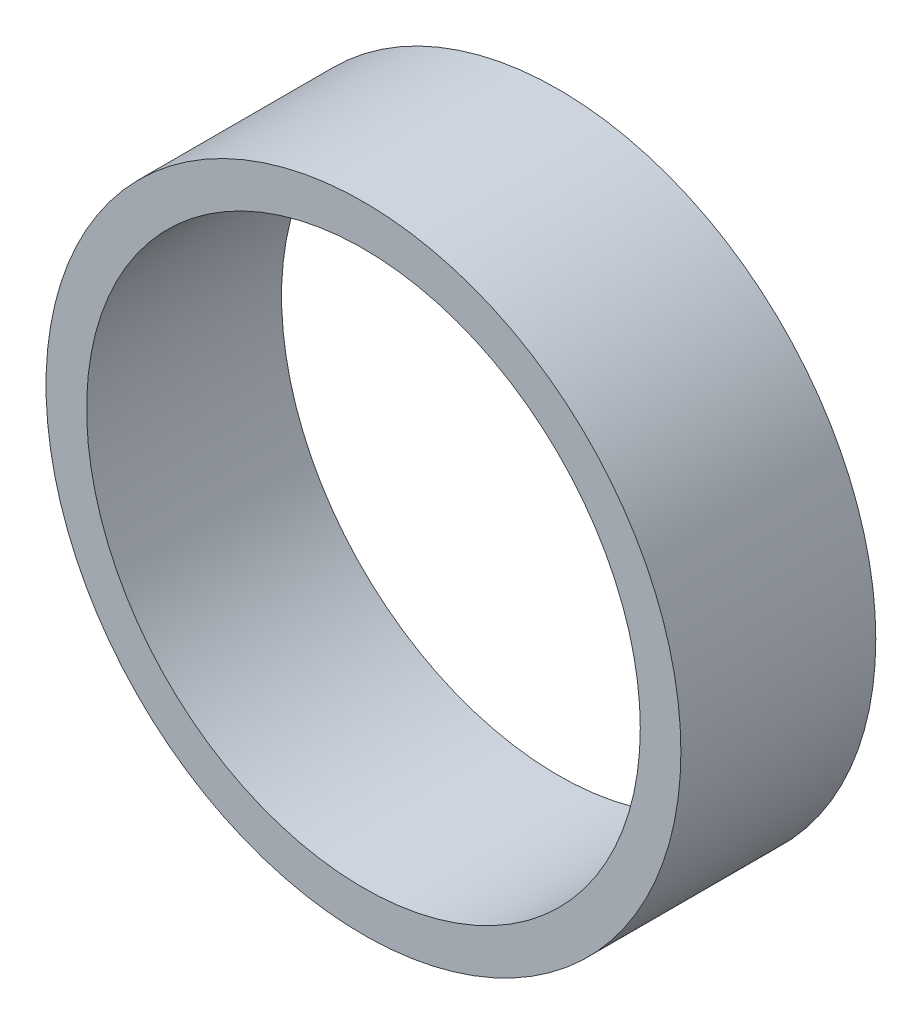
ISO-10303-21;
HEADER;
FILE_DESCRIPTION(('STEP AP214'),'2;1');
FILE_NAME('part.step','',(''),(''),'','','');
FILE_SCHEMA(('AUTOMOTIVE_DESIGN { 1 0 10303 214 1 1 1 1 }'));
ENDSEC;
DATA;
#1=APPLICATION_CONTEXT('core data for automotive mechanical design processes');
#2=APPLICATION_PROTOCOL_DEFINITION('international standard','automotive_design',2000,#1);
#3=PRODUCT_CONTEXT('',#1,'mechanical');
#4=PRODUCT('Part','Part','',(#3));
#5=PRODUCT_RELATED_PRODUCT_CATEGORY('part','',(#4));
#6=PRODUCT_DEFINITION_FORMATION('','',#4);
#7=PRODUCT_DEFINITION_CONTEXT('part definition',#1,'design');
#8=PRODUCT_DEFINITION('design','',#6,#7);
#9=PRODUCT_DEFINITION_SHAPE('','',#8);
#10=(LENGTH_UNIT() NAMED_UNIT(*) SI_UNIT(.MILLI.,.METRE.));
#11=(NAMED_UNIT(*) PLANE_ANGLE_UNIT() SI_UNIT($,.RADIAN.));
#12=(NAMED_UNIT(*) SI_UNIT($,.STERADIAN.) SOLID_ANGLE_UNIT());
#13=UNCERTAINTY_MEASURE_WITH_UNIT(LENGTH_MEASURE(1.E-05),#10,'distance_accuracy_value','');
#14=(GEOMETRIC_REPRESENTATION_CONTEXT(3) GLOBAL_UNCERTAINTY_ASSIGNED_CONTEXT((#13)) GLOBAL_UNIT_ASSIGNED_CONTEXT((#10,
#11,#12)) REPRESENTATION_CONTEXT('',''));
#15=CARTESIAN_POINT('',(0.,0.,0.));
#16=DIRECTION('',(0.,0.,1.));
#17=DIRECTION('',(1.,0.,0.));
#18=AXIS2_PLACEMENT_3D('',#15,#16,#17);
#19=CARTESIAN_POINT('',(0.,0.,13.2));
#20=DIRECTION('',(0.,0.,1.));
#21=DIRECTION('',(1.,0.,0.));
#22=AXIS2_PLACEMENT_3D('',#19,#20,#21);
#23=PLANE('',#22);
#24=CARTESIAN_POINT('',(0.,0.,13.2));
#25=DIRECTION('',(0.,0.,1.));
#26=DIRECTION('',(1.,0.,0.));
#27=AXIS2_PLACEMENT_3D('',#24,#25,#26);
#28=CIRCLE('',#27,21.5);
#29=CARTESIAN_POINT('',(21.5,0.,13.2));
#30=VERTEX_POINT('',#29);
#31=EDGE_CURVE('E10',#30,#30,#28,.T.);
#32=ORIENTED_EDGE('',*,*,#31,.T.);
#33=EDGE_LOOP('',(#32));
#34=FACE_BOUND('',#33,.T.);
#35=CARTESIAN_POINT('',(0.,0.,13.2));
#36=DIRECTION('',(0.,0.,1.));
#37=DIRECTION('',(1.,0.,0.));
#38=AXIS2_PLACEMENT_3D('',#35,#36,#37);
#39=CIRCLE('',#38,18.75);
#40=CARTESIAN_POINT('',(18.75,0.,13.2));
#41=VERTEX_POINT('',#40);
#42=EDGE_CURVE('E41',#41,#41,#39,.T.);
#43=ORIENTED_EDGE('',*,*,#42,.F.);
#44=EDGE_LOOP('',(#43));
#45=FACE_BOUND('',#44,.T.);
#46=ADVANCED_FACE('F30',(#34,#45),#23,.T.);
#47=CARTESIAN_POINT('',(0.,0.,0.));
#48=DIRECTION('',(0.,0.,1.));
#49=DIRECTION('',(1.,0.,0.));
#50=AXIS2_PLACEMENT_3D('',#47,#48,#49);
#51=PLANE('',#50);
#52=CARTESIAN_POINT('',(0.,0.,0.));
#53=DIRECTION('',(0.,0.,1.));
#54=DIRECTION('',(1.,0.,0.));
#55=AXIS2_PLACEMENT_3D('',#52,#53,#54);
#56=CIRCLE('',#55,21.5);
#57=CARTESIAN_POINT('',(21.5,0.,0.));
#58=VERTEX_POINT('',#57);
#59=EDGE_CURVE('E37',#58,#58,#56,.T.);
#60=ORIENTED_EDGE('',*,*,#59,.F.);
#61=EDGE_LOOP('',(#60));
#62=FACE_BOUND('',#61,.T.);
#63=CARTESIAN_POINT('',(0.,0.,0.));
#64=DIRECTION('',(0.,0.,1.));
#65=DIRECTION('',(1.,0.,0.));
#66=AXIS2_PLACEMENT_3D('',#63,#64,#65);
#67=CIRCLE('',#66,18.75);
#68=CARTESIAN_POINT('',(18.75,0.,0.));
#69=VERTEX_POINT('',#68);
#70=EDGE_CURVE('E45',#69,#69,#67,.T.);
#71=ORIENTED_EDGE('',*,*,#70,.T.);
#72=EDGE_LOOP('',(#71));
#73=FACE_BOUND('',#72,.T.);
#74=ADVANCED_FACE('F51',(#62,#73),#51,.F.);
#75=CARTESIAN_POINT('',(0.,0.,13.2));
#76=DIRECTION('',(0.,0.,-1.));
#77=DIRECTION('',(-1.,0.,0.));
#78=AXIS2_PLACEMENT_3D('',#75,#76,#77);
#79=CYLINDRICAL_SURFACE('',#78,21.5);
#80=ORIENTED_EDGE('',*,*,#31,.F.);
#81=EDGE_LOOP('',(#80));
#82=FACE_BOUND('',#81,.T.);
#83=ORIENTED_EDGE('',*,*,#59,.T.);
#84=EDGE_LOOP('',(#83));
#85=FACE_BOUND('',#84,.T.);
#86=ADVANCED_FACE('F32',(#82,#85),#79,.T.);
#87=CARTESIAN_POINT('',(0.,0.,13.2));
#88=DIRECTION('',(0.,0.,-1.));
#89=DIRECTION('',(-1.,0.,0.));
#90=AXIS2_PLACEMENT_3D('',#87,#88,#89);
#91=CYLINDRICAL_SURFACE('',#90,18.75);
#92=ORIENTED_EDGE('',*,*,#42,.T.);
#93=EDGE_LOOP('',(#92));
#94=FACE_BOUND('',#93,.T.);
#95=ORIENTED_EDGE('',*,*,#70,.F.);
#96=EDGE_LOOP('',(#95));
#97=FACE_BOUND('',#96,.T.);
#98=ADVANCED_FACE('F53',(#94,#97),#91,.F.);
#99=CLOSED_SHELL('',(#46,#74,#86,#98));
#100=MANIFOLD_SOLID_BREP('B2',#99);
#101=ADVANCED_BREP_SHAPE_REPRESENTATION('',(#18,#100),#14);
#102=SHAPE_DEFINITION_REPRESENTATION(#9,#101);
ENDSEC;
END-ISO-10303-21;
